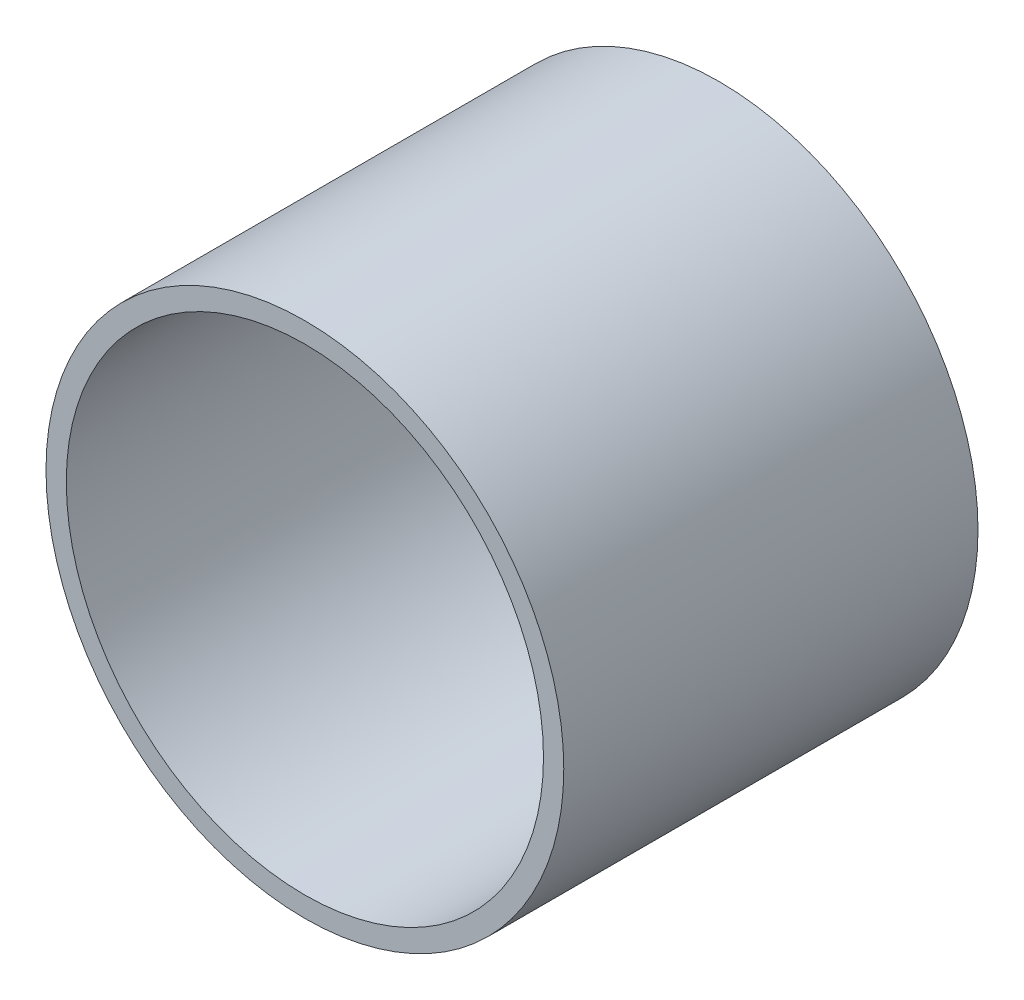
from build123d import *

# Parameters (mm, degrees)
SKETCH12_R      = 15.875
SKETCH12_R_2    = 14.6304
F_1_25_OD_DEPTH = 25.4


with BuildPart() as part:
    # Sketch12 → 1.25_ OD (new body)
    with BuildSketch(Plane.YX):
        Circle(SKETCH12_R)
        Circle(SKETCH12_R_2, mode=Mode.SUBTRACT)
    extrude(amount=F_1_25_OD_DEPTH)


solid = part.part
